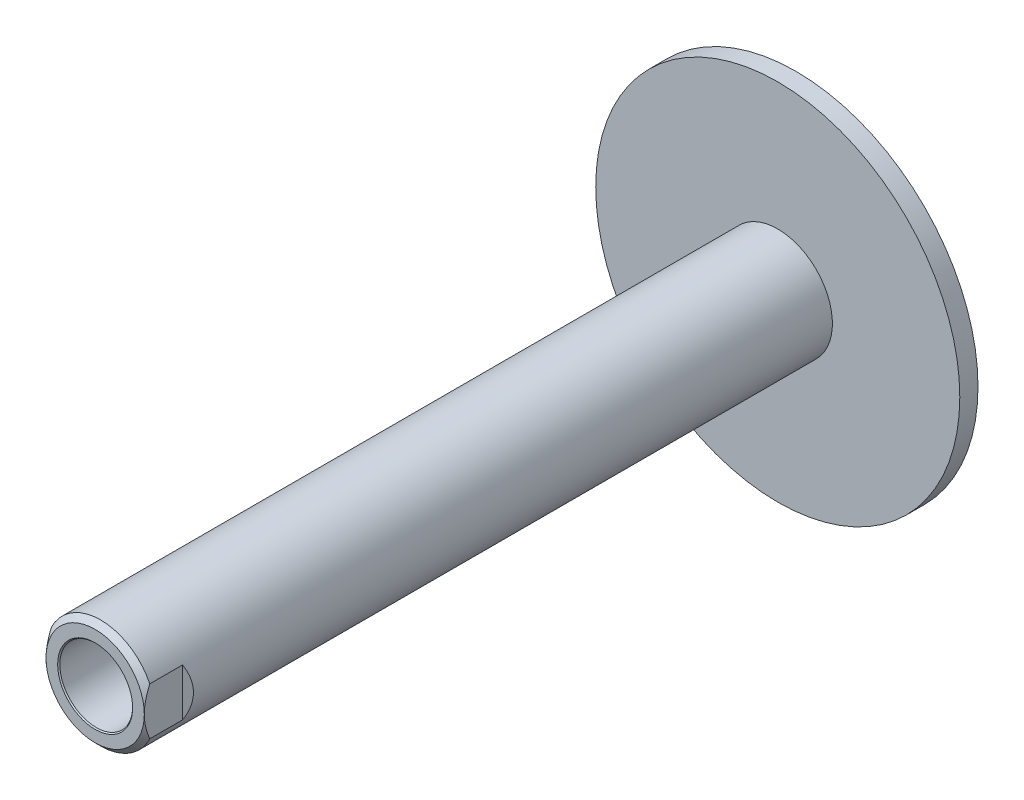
ISO-10303-21;
HEADER;
FILE_DESCRIPTION(('STEP AP214'),'2;1');
FILE_NAME('part.step','',(''),(''),'','','');
FILE_SCHEMA(('AUTOMOTIVE_DESIGN { 1 0 10303 214 1 1 1 1 }'));
ENDSEC;
DATA;
#1=APPLICATION_CONTEXT('core data for automotive mechanical design processes');
#2=APPLICATION_PROTOCOL_DEFINITION('international standard','automotive_design',2000,#1);
#3=PRODUCT_CONTEXT('',#1,'mechanical');
#4=PRODUCT('Part','Part','',(#3));
#5=PRODUCT_RELATED_PRODUCT_CATEGORY('part','',(#4));
#6=PRODUCT_DEFINITION_FORMATION('','',#4);
#7=PRODUCT_DEFINITION_CONTEXT('part definition',#1,'design');
#8=PRODUCT_DEFINITION('design','',#6,#7);
#9=PRODUCT_DEFINITION_SHAPE('','',#8);
#10=(LENGTH_UNIT() NAMED_UNIT(*) SI_UNIT(.MILLI.,.METRE.));
#11=(NAMED_UNIT(*) PLANE_ANGLE_UNIT() SI_UNIT($,.RADIAN.));
#12=(NAMED_UNIT(*) SI_UNIT($,.STERADIAN.) SOLID_ANGLE_UNIT());
#13=UNCERTAINTY_MEASURE_WITH_UNIT(LENGTH_MEASURE(1.E-05),#10,'distance_accuracy_value','');
#14=(GEOMETRIC_REPRESENTATION_CONTEXT(3) GLOBAL_UNCERTAINTY_ASSIGNED_CONTEXT((#13)) GLOBAL_UNIT_ASSIGNED_CONTEXT((#10,
#11,#12)) REPRESENTATION_CONTEXT('',''));
#15=CARTESIAN_POINT('',(0.,0.,0.));
#16=DIRECTION('',(0.,0.,1.));
#17=DIRECTION('',(1.,0.,0.));
#18=AXIS2_PLACEMENT_3D('',#15,#16,#17);
#19=CARTESIAN_POINT('',(0.,0.,5.));
#20=DIRECTION('',(0.,0.,-1.));
#21=DIRECTION('',(-1.,0.,0.));
#22=AXIS2_PLACEMENT_3D('',#19,#20,#21);
#23=CYLINDRICAL_SURFACE('',#22,15.);
#24=CARTESIAN_POINT('',(0.,0.,191.));
#25=DIRECTION('',(0.,0.,-1.));
#26=DIRECTION('',(-1.,0.,0.));
#27=AXIS2_PLACEMENT_3D('',#24,#25,#26);
#28=CIRCLE('',#27,15.);
#29=CARTESIAN_POINT('',(13.5,-6.538348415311,191.));
#30=VERTEX_POINT('',#29);
#31=CARTESIAN_POINT('',(-13.5,-6.538348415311,191.));
#32=VERTEX_POINT('',#31);
#33=EDGE_CURVE('E103',#30,#32,#28,.T.);
#34=ORIENTED_EDGE('',*,*,#33,.T.);
#35=DIRECTION('',(0.,0.,1.));
#36=VECTOR('',#35,1.);
#37=CARTESIAN_POINT('',(-13.5,-6.538348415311,180.5));
#38=LINE('',#37,#36);
#39=CARTESIAN_POINT('',(-13.5,-6.538348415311,182.));
#40=VERTEX_POINT('',#39);
#41=EDGE_CURVE('E85',#40,#32,#38,.T.);
#42=ORIENTED_EDGE('',*,*,#41,.F.);
#43=CARTESIAN_POINT('',(0.,0.,195.5));
#44=DIRECTION('',(0.707106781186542,0.,-0.707106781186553));
#45=DIRECTION('',(-0.707106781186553,0.,-0.707106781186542));
#46=AXIS2_PLACEMENT_3D('',#43,#44,#45);
#47=ELLIPSE('',#46,21.2132034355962,15.);
#48=CARTESIAN_POINT('',(-15.,0.,180.5));
#49=VERTEX_POINT('',#48);
#50=EDGE_CURVE('E56',#40,#49,#47,.T.);
#51=ORIENTED_EDGE('',*,*,#50,.T.);
#52=CARTESIAN_POINT('',(0.,0.,195.5));
#53=DIRECTION('',(0.707106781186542,0.,-0.707106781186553));
#54=DIRECTION('',(-0.707106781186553,0.,-0.707106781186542));
#55=AXIS2_PLACEMENT_3D('',#52,#53,#54);
#56=ELLIPSE('',#55,21.2132034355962,15.);
#57=CARTESIAN_POINT('',(-13.5,6.538348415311,182.));
#58=VERTEX_POINT('',#57);
#59=EDGE_CURVE('E199',#49,#58,#56,.T.);
#60=ORIENTED_EDGE('',*,*,#59,.T.);
#61=DIRECTION('',(0.,0.,1.));
#62=VECTOR('',#61,1.);
#63=CARTESIAN_POINT('',(-13.5,6.538348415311,180.5));
#64=LINE('',#63,#62);
#65=CARTESIAN_POINT('',(-13.5,6.538348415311,191.));
#66=VERTEX_POINT('',#65);
#67=EDGE_CURVE('E95',#58,#66,#64,.T.);
#68=ORIENTED_EDGE('',*,*,#67,.T.);
#69=CARTESIAN_POINT('',(13.5,6.538348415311,191.));
#70=VERTEX_POINT('',#69);
#71=EDGE_CURVE('E112',#66,#70,#28,.T.);
#72=ORIENTED_EDGE('',*,*,#71,.T.);
#73=DIRECTION('',(0.,0.,1.));
#74=VECTOR('',#73,1.);
#75=CARTESIAN_POINT('',(13.5,6.538348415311,180.5));
#76=LINE('',#75,#74);
#77=CARTESIAN_POINT('',(13.5,6.538348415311,182.));
#78=VERTEX_POINT('',#77);
#79=EDGE_CURVE('E118',#78,#70,#76,.T.);
#80=ORIENTED_EDGE('',*,*,#79,.F.);
#81=CARTESIAN_POINT('',(0.,0.,195.5));
#82=DIRECTION('',(-0.707106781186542,0.,-0.707106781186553));
#83=DIRECTION('',(0.707106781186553,0.,-0.707106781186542));
#84=AXIS2_PLACEMENT_3D('',#81,#82,#83);
#85=ELLIPSE('',#84,21.2132034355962,15.);
#86=CARTESIAN_POINT('',(15.,0.,180.5));
#87=VERTEX_POINT('',#86);
#88=EDGE_CURVE('E49',#78,#87,#85,.T.);
#89=ORIENTED_EDGE('',*,*,#88,.T.);
#90=CARTESIAN_POINT('',(0.,0.,195.5));
#91=DIRECTION('',(-0.707106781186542,0.,-0.707106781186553));
#92=DIRECTION('',(0.707106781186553,0.,-0.707106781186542));
#93=AXIS2_PLACEMENT_3D('',#90,#91,#92);
#94=ELLIPSE('',#93,21.2132034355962,15.);
#95=CARTESIAN_POINT('',(13.5,-6.538348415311,182.));
#96=VERTEX_POINT('',#95);
#97=EDGE_CURVE('E204',#87,#96,#94,.T.);
#98=ORIENTED_EDGE('',*,*,#97,.T.);
#99=DIRECTION('',(0.,0.,1.));
#100=VECTOR('',#99,1.);
#101=CARTESIAN_POINT('',(13.5,-6.538348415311,180.5));
#102=LINE('',#101,#100);
#103=EDGE_CURVE('E110',#96,#30,#102,.T.);
#104=ORIENTED_EDGE('',*,*,#103,.T.);
#105=EDGE_LOOP('',(#34,#42,#51,#60,#68,#72,#80,#89,#98,#104));
#106=FACE_BOUND('',#105,.T.);
#107=CARTESIAN_POINT('',(0.,0.,5.));
#108=DIRECTION('',(0.,0.,-1.));
#109=DIRECTION('',(-1.,0.,0.));
#110=AXIS2_PLACEMENT_3D('',#107,#108,#109);
#111=CIRCLE('',#110,15.);
#112=CARTESIAN_POINT('',(-15.,0.,5.));
#113=VERTEX_POINT('',#112);
#114=EDGE_CURVE('E11',#113,#113,#111,.T.);
#115=ORIENTED_EDGE('',*,*,#114,.F.);
#116=EDGE_LOOP('',(#115));
#117=FACE_BOUND('',#116,.T.);
#118=ADVANCED_FACE('F34',(#106,#117),#23,.T.);
#119=CARTESIAN_POINT('',(0.,0.,191.));
#120=DIRECTION('',(0.,0.,-1.));
#121=DIRECTION('',(-1.,0.,0.));
#122=AXIS2_PLACEMENT_3D('',#119,#120,#121);
#123=CONICAL_SURFACE('',#122,15.,0.785398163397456);
#124=CARTESIAN_POINT('',(-13.5,-14.1093196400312,186.472509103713));
#125=CARTESIAN_POINT('',(-13.5,-13.7600597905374,186.724804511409));
#126=CARTESIAN_POINT('',(-13.5,-13.4087034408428,186.974247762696));
#127=CARTESIAN_POINT('',(-13.5,-12.7010407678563,187.466216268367));
#128=CARTESIAN_POINT('',(-13.5,-12.3447330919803,187.70873957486));
#129=CARTESIAN_POINT('',(-13.5,-11.6238899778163,188.187314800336));
#130=CARTESIAN_POINT('',(-13.5,-11.2593126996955,188.423303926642));
#131=CARTESIAN_POINT('',(-13.5,-10.5238062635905,188.885136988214));
#132=CARTESIAN_POINT('',(-13.5,-10.1528775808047,189.110981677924));
#133=CARTESIAN_POINT('',(-13.5,-9.38688961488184,189.560317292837));
#134=CARTESIAN_POINT('',(-13.5,-8.99149666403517,189.783242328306));
#135=CARTESIAN_POINT('',(-13.5,-8.1917499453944,190.21263349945));
#136=CARTESIAN_POINT('',(-13.5,-7.7873949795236,190.419097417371));
#137=CARTESIAN_POINT('',(-13.5,-6.97004306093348,190.811080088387));
#138=CARTESIAN_POINT('',(-13.5,-6.5570749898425,190.996658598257));
#139=CARTESIAN_POINT('',(-13.5,-5.72086976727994,191.342796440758));
#140=CARTESIAN_POINT('',(-13.5,-5.29763679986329,191.503365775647));
#141=CARTESIAN_POINT('',(-13.5,-4.45321540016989,191.789858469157));
#142=CARTESIAN_POINT('',(-13.5,-4.03232652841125,191.91665479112));
#143=CARTESIAN_POINT('',(-13.5,-3.18160115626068,192.13623887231));
#144=CARTESIAN_POINT('',(-13.5,-2.75176397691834,192.229024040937));
#145=CARTESIAN_POINT('',(-13.5,-1.89221463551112,192.374507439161));
#146=CARTESIAN_POINT('',(-13.5,-1.46260700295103,192.427813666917));
#147=CARTESIAN_POINT('',(-13.5,-0.600261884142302,192.493496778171));
#148=CARTESIAN_POINT('',(-13.5,-0.167524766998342,192.505878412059));
#149=CARTESIAN_POINT('',(-13.5,0.686470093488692,192.489136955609));
#150=CARTESIAN_POINT('',(-13.5,1.10774839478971,192.461027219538));
#151=CARTESIAN_POINT('',(-13.5,1.94601035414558,192.366828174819));
#152=CARTESIAN_POINT('',(-13.5,2.36299355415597,192.300734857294));
#153=CARTESIAN_POINT('',(-13.5,3.19667688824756,192.132802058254));
#154=CARTESIAN_POINT('',(-13.5,3.61326149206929,192.030397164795));
#155=CARTESIAN_POINT('',(-13.5,4.43747560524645,191.794891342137));
#156=CARTESIAN_POINT('',(-13.5,4.84510627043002,191.66179440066));
#157=CARTESIAN_POINT('',(-13.5,5.72286800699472,191.343765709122));
#158=CARTESIAN_POINT('',(-13.5,6.19116936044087,191.153822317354));
#159=CARTESIAN_POINT('',(-13.5,7.11523971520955,190.745338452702));
#160=CARTESIAN_POINT('',(-13.5,7.57100225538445,190.526783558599));
#161=CARTESIAN_POINT('',(-13.5,8.47243764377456,190.066338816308));
#162=CARTESIAN_POINT('',(-13.5,8.91807108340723,189.824372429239));
#163=CARTESIAN_POINT('',(-13.5,9.79895577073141,189.322513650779));
#164=CARTESIAN_POINT('',(-13.5,10.2342087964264,189.062624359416));
#165=CARTESIAN_POINT('',(-13.5,11.0737308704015,188.542201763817));
#166=CARTESIAN_POINT('',(-13.5,11.4784451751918,188.282382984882));
#167=CARTESIAN_POINT('',(-13.5,12.2809503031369,187.752232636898));
#168=CARTESIAN_POINT('',(-13.5,12.6787405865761,187.481900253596));
#169=CARTESIAN_POINT('',(-13.5,13.4650094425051,186.93491654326));
#170=CARTESIAN_POINT('',(-13.5,13.8535380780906,186.658337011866));
#171=CARTESIAN_POINT('',(-13.5,14.4324369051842,186.238227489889));
#172=CARTESIAN_POINT('',(-13.5,14.6247300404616,186.097335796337));
#173=CARTESIAN_POINT('',(-13.5,15.0081193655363,185.813940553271));
#174=CARTESIAN_POINT('',(-13.5,15.1992155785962,185.671437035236));
#175=CARTESIAN_POINT('',(-13.5,15.3897591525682,185.528197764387));
#176=B_SPLINE_CURVE_WITH_KNOTS('',3,(#124,#125,#126,#127,#128,#129,#130,#131,#132,#133,#134,
#135,#136,#137,#138,#139,#140,#141,#142,#143,#144,#145,#146,#147,#148,#149,#150,#151,#152,#153,
#154,#155,#156,#157,#158,#159,#160,#161,#162,#163,#164,#165,#166,#167,#168,#169,#170,#171,#172,
#173,#174,#175),.UNSPECIFIED.,.F.,.F.,(4,2,2,2,2,2,2,2,2,2,2,2,2,2,2,2,2,2,2,2,2,2,2,2,2,4),(0.,
1.29259193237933,2.58554419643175,3.88827218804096,5.19090313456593,6.5523036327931,
7.91388723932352,9.27147037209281,10.6285091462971,11.9460185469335,13.2636282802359,
14.5604982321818,15.8572176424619,17.1220431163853,18.3870021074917,19.6725915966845,
20.958014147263,22.4728538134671,23.9884599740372,25.5092002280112,27.0296781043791,
28.4722925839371,29.9150190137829,31.3456741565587,32.0608205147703,32.7759529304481),.UNSPECIFIED.);
#177=CARTESIAN_POINT('',(-13.5,0.,192.5));
#178=VERTEX_POINT('',#177);
#179=EDGE_CURVE('E90',#32,#178,#176,.T.);
#180=ORIENTED_EDGE('',*,*,#179,.F.);
#181=ORIENTED_EDGE('',*,*,#33,.F.);
#182=CARTESIAN_POINT('',(13.5,-14.1093196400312,186.472509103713));
#183=CARTESIAN_POINT('',(13.5,-13.7600597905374,186.724804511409));
#184=CARTESIAN_POINT('',(13.5,-13.4087034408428,186.974247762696));
#185=CARTESIAN_POINT('',(13.5,-12.7010407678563,187.466216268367));
#186=CARTESIAN_POINT('',(13.5,-12.3447330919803,187.70873957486));
#187=CARTESIAN_POINT('',(13.5,-11.6238899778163,188.187314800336));
#188=CARTESIAN_POINT('',(13.5,-11.2593126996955,188.423303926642));
#189=CARTESIAN_POINT('',(13.5,-10.5238062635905,188.885136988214));
#190=CARTESIAN_POINT('',(13.5,-10.1528775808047,189.110981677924));
#191=CARTESIAN_POINT('',(13.5,-9.38688961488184,189.560317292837));
#192=CARTESIAN_POINT('',(13.5,-8.99149666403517,189.783242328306));
#193=CARTESIAN_POINT('',(13.5,-8.1917499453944,190.21263349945));
#194=CARTESIAN_POINT('',(13.5,-7.7873949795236,190.419097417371));
#195=CARTESIAN_POINT('',(13.5,-6.97004306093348,190.811080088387));
#196=CARTESIAN_POINT('',(13.5,-6.5570749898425,190.996658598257));
#197=CARTESIAN_POINT('',(13.5,-5.72086976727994,191.342796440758));
#198=CARTESIAN_POINT('',(13.5,-5.29763679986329,191.503365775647));
#199=CARTESIAN_POINT('',(13.5,-4.45321540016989,191.789858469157));
#200=CARTESIAN_POINT('',(13.5,-4.03232652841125,191.91665479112));
#201=CARTESIAN_POINT('',(13.5,-3.18160115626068,192.13623887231));
#202=CARTESIAN_POINT('',(13.5,-2.75176397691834,192.229024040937));
#203=CARTESIAN_POINT('',(13.5,-1.89221463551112,192.374507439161));
#204=CARTESIAN_POINT('',(13.5,-1.46260700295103,192.427813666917));
#205=CARTESIAN_POINT('',(13.5,-0.600261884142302,192.493496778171));
#206=CARTESIAN_POINT('',(13.5,-0.167524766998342,192.505878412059));
#207=CARTESIAN_POINT('',(13.5,0.686470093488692,192.489136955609));
#208=CARTESIAN_POINT('',(13.5,1.10774839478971,192.461027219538));
#209=CARTESIAN_POINT('',(13.5,1.94601035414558,192.366828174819));
#210=CARTESIAN_POINT('',(13.5,2.36299355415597,192.300734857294));
#211=CARTESIAN_POINT('',(13.5,3.19667688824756,192.132802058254));
#212=CARTESIAN_POINT('',(13.5,3.61326149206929,192.030397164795));
#213=CARTESIAN_POINT('',(13.5,4.43747560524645,191.794891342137));
#214=CARTESIAN_POINT('',(13.5,4.84510627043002,191.66179440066));
#215=CARTESIAN_POINT('',(13.5,5.72286800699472,191.343765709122));
#216=CARTESIAN_POINT('',(13.5,6.19116936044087,191.153822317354));
#217=CARTESIAN_POINT('',(13.5,7.11523971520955,190.745338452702));
#218=CARTESIAN_POINT('',(13.5,7.57100225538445,190.526783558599));
#219=CARTESIAN_POINT('',(13.5,8.47243764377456,190.066338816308));
#220=CARTESIAN_POINT('',(13.5,8.91807108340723,189.824372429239));
#221=CARTESIAN_POINT('',(13.5,9.79895577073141,189.322513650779));
#222=CARTESIAN_POINT('',(13.5,10.2342087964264,189.062624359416));
#223=CARTESIAN_POINT('',(13.5,11.0737308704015,188.542201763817));
#224=CARTESIAN_POINT('',(13.5,11.4784451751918,188.282382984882));
#225=CARTESIAN_POINT('',(13.5,12.2809503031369,187.752232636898));
#226=CARTESIAN_POINT('',(13.5,12.6787405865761,187.481900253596));
#227=CARTESIAN_POINT('',(13.5,13.4650094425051,186.93491654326));
#228=CARTESIAN_POINT('',(13.5,13.8535380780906,186.658337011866));
#229=CARTESIAN_POINT('',(13.5,14.4324369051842,186.238227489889));
#230=CARTESIAN_POINT('',(13.5,14.6247300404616,186.097335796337));
#231=CARTESIAN_POINT('',(13.5,15.0081193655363,185.813940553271));
#232=CARTESIAN_POINT('',(13.5,15.1992155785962,185.671437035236));
#233=CARTESIAN_POINT('',(13.5,15.3897591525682,185.528197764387));
#234=B_SPLINE_CURVE_WITH_KNOTS('',3,(#182,#183,#184,#185,#186,#187,#188,#189,#190,#191,#192,
#193,#194,#195,#196,#197,#198,#199,#200,#201,#202,#203,#204,#205,#206,#207,#208,#209,#210,#211,
#212,#213,#214,#215,#216,#217,#218,#219,#220,#221,#222,#223,#224,#225,#226,#227,#228,#229,#230,
#231,#232,#233),.UNSPECIFIED.,.F.,.F.,(4,2,2,2,2,2,2,2,2,2,2,2,2,2,2,2,2,2,2,2,2,2,2,2,2,4),(0.,
1.29259193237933,2.58554419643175,3.88827218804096,5.19090313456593,6.5523036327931,
7.91388723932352,9.27147037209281,10.6285091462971,11.9460185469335,13.2636282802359,
14.5604982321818,15.8572176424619,17.1220431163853,18.3870021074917,19.6725915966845,
20.958014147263,22.4728538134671,23.9884599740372,25.5092002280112,27.0296781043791,
28.4722925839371,29.9150190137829,31.3456741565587,32.0608205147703,32.7759529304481),.UNSPECIFIED.);
#235=CARTESIAN_POINT('',(13.5,0.,192.5));
#236=VERTEX_POINT('',#235);
#237=EDGE_CURVE('E121',#236,#30,#234,.F.);
#238=ORIENTED_EDGE('',*,*,#237,.F.);
#239=CARTESIAN_POINT('',(0.,0.,192.5));
#240=DIRECTION('',(0.,0.,-1.));
#241=DIRECTION('',(-1.,0.,0.));
#242=AXIS2_PLACEMENT_3D('',#239,#240,#241);
#243=CIRCLE('',#242,13.5);
#244=EDGE_CURVE('E104',#178,#236,#243,.F.);
#245=ORIENTED_EDGE('',*,*,#244,.F.);
#246=EDGE_LOOP('',(#180,#181,#238,#245));
#247=FACE_BOUND('',#246,.T.);
#248=ADVANCED_FACE('F101',(#247),#123,.T.);
#249=CARTESIAN_POINT('',(0.,0.,192.5));
#250=DIRECTION('',(0.,0.,-1.));
#251=DIRECTION('',(-1.,0.,0.));
#252=AXIS2_PLACEMENT_3D('',#249,#250,#251);
#253=PLANE('',#252);
#254=CARTESIAN_POINT('',(0.,0.,192.5));
#255=DIRECTION('',(0.,0.,-1.));
#256=DIRECTION('',(-1.,0.,0.));
#257=AXIS2_PLACEMENT_3D('',#254,#255,#256);
#258=CIRCLE('',#257,10.3);
#259=CARTESIAN_POINT('',(-10.3,0.,192.5));
#260=VERTEX_POINT('',#259);
#261=EDGE_CURVE('E42',#260,#260,#258,.T.);
#262=ORIENTED_EDGE('',*,*,#261,.T.);
#263=EDGE_LOOP('',(#262));
#264=FACE_BOUND('',#263,.T.);
#265=EDGE_CURVE('E114',#236,#178,#243,.F.);
#266=ORIENTED_EDGE('',*,*,#265,.T.);
#267=ORIENTED_EDGE('',*,*,#244,.T.);
#268=EDGE_LOOP('',(#266,#267));
#269=FACE_BOUND('',#268,.T.);
#270=ADVANCED_FACE('F141',(#264,#269),#253,.F.);
#271=EDGE_CURVE('E106',#178,#66,#176,.T.);
#272=ORIENTED_EDGE('',*,*,#271,.F.);
#273=ORIENTED_EDGE('',*,*,#265,.F.);
#274=EDGE_CURVE('E127',#70,#236,#234,.F.);
#275=ORIENTED_EDGE('',*,*,#274,.F.);
#276=ORIENTED_EDGE('',*,*,#71,.F.);
#277=EDGE_LOOP('',(#272,#273,#275,#276));
#278=FACE_BOUND('',#277,.T.);
#279=ADVANCED_FACE('F136',(#278),#123,.T.);
#280=CARTESIAN_POINT('',(13.5,6.538348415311,180.5));
#281=DIRECTION('',(-1.,0.,0.));
#282=DIRECTION('',(0.,0.,1.));
#283=AXIS2_PLACEMENT_3D('',#280,#281,#282);
#284=PLANE('',#283);
#285=ORIENTED_EDGE('',*,*,#103,.F.);
#286=DIRECTION('',(0.,1.,0.));
#287=VECTOR('',#286,1.);
#288=CARTESIAN_POINT('',(13.5,6.538348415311,182.));
#289=LINE('',#288,#287);
#290=EDGE_CURVE('E196',#96,#78,#289,.T.);
#291=ORIENTED_EDGE('',*,*,#290,.T.);
#292=ORIENTED_EDGE('',*,*,#79,.T.);
#293=ORIENTED_EDGE('',*,*,#274,.T.);
#294=ORIENTED_EDGE('',*,*,#237,.T.);
#295=EDGE_LOOP('',(#285,#291,#292,#293,#294));
#296=FACE_BOUND('',#295,.T.);
#297=ADVANCED_FACE('F133',(#296),#284,.F.);
#298=CARTESIAN_POINT('',(-13.5,6.538348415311,180.5));
#299=DIRECTION('',(1.,0.,0.));
#300=DIRECTION('',(0.,0.,-1.));
#301=AXIS2_PLACEMENT_3D('',#298,#299,#300);
#302=PLANE('',#301);
#303=ORIENTED_EDGE('',*,*,#67,.F.);
#304=DIRECTION('',(0.,-1.,0.));
#305=VECTOR('',#304,1.);
#306=CARTESIAN_POINT('',(-13.5,6.538348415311,182.));
#307=LINE('',#306,#305);
#308=EDGE_CURVE('E93',#58,#40,#307,.T.);
#309=ORIENTED_EDGE('',*,*,#308,.T.);
#310=ORIENTED_EDGE('',*,*,#41,.T.);
#311=ORIENTED_EDGE('',*,*,#179,.T.);
#312=ORIENTED_EDGE('',*,*,#271,.T.);
#313=EDGE_LOOP('',(#303,#309,#310,#311,#312));
#314=FACE_BOUND('',#313,.T.);
#315=ADVANCED_FACE('F88',(#314),#302,.F.);
#316=CARTESIAN_POINT('',(-15.,0.,180.5));
#317=DIRECTION('',(0.707106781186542,0.,-0.707106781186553));
#318=DIRECTION('',(-0.707106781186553,0.,-0.707106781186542));
#319=AXIS2_PLACEMENT_3D('',#316,#317,#318);
#320=PLANE('',#319);
#321=ORIENTED_EDGE('',*,*,#50,.F.);
#322=ORIENTED_EDGE('',*,*,#308,.F.);
#323=ORIENTED_EDGE('',*,*,#59,.F.);
#324=EDGE_LOOP('',(#321,#322,#323));
#325=FACE_BOUND('',#324,.T.);
#326=ADVANCED_FACE('F144',(#325),#320,.F.);
#327=CARTESIAN_POINT('',(15.,0.,180.5));
#328=DIRECTION('',(-0.707106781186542,0.,-0.707106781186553));
#329=DIRECTION('',(-0.707106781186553,0.,0.707106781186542));
#330=AXIS2_PLACEMENT_3D('',#327,#328,#329);
#331=PLANE('',#330);
#332=ORIENTED_EDGE('',*,*,#88,.F.);
#333=ORIENTED_EDGE('',*,*,#290,.F.);
#334=ORIENTED_EDGE('',*,*,#97,.F.);
#335=EDGE_LOOP('',(#332,#333,#334));
#336=FACE_BOUND('',#335,.T.);
#337=ADVANCED_FACE('F147',(#336),#331,.F.);
#338=CARTESIAN_POINT('',(0.,0.,165.5));
#339=DIRECTION('',(0.,0.,1.));
#340=DIRECTION('',(1.,0.,0.));
#341=AXIS2_PLACEMENT_3D('',#338,#339,#340);
#342=CYLINDRICAL_SURFACE('',#341,10.);
#343=CARTESIAN_POINT('',(0.,0.,192.2));
#344=DIRECTION('',(0.,0.,-1.));
#345=DIRECTION('',(-1.,0.,0.));
#346=AXIS2_PLACEMENT_3D('',#343,#344,#345);
#347=CIRCLE('',#346,10.);
#348=CARTESIAN_POINT('',(-10.,0.,192.2));
#349=VERTEX_POINT('',#348);
#350=EDGE_CURVE('E207',#349,#349,#347,.F.);
#351=ORIENTED_EDGE('',*,*,#350,.T.);
#352=EDGE_LOOP('',(#351));
#353=FACE_BOUND('',#352,.T.);
#354=CARTESIAN_POINT('',(0.,0.,165.5));
#355=DIRECTION('',(0.,0.,1.));
#356=DIRECTION('',(1.,0.,0.));
#357=AXIS2_PLACEMENT_3D('',#354,#355,#356);
#358=CIRCLE('',#357,10.);
#359=CARTESIAN_POINT('',(10.,0.,165.5));
#360=VERTEX_POINT('',#359);
#361=EDGE_CURVE('E96',#360,#360,#358,.T.);
#362=ORIENTED_EDGE('',*,*,#361,.F.);
#363=EDGE_LOOP('',(#362));
#364=FACE_BOUND('',#363,.T.);
#365=ADVANCED_FACE('F150',(#353,#364),#342,.F.);
#366=CARTESIAN_POINT('',(0.,0.,165.5));
#367=DIRECTION('',(0.,0.,1.));
#368=DIRECTION('',(1.,0.,0.));
#369=AXIS2_PLACEMENT_3D('',#366,#367,#368);
#370=PLANE('',#369);
#371=ORIENTED_EDGE('',*,*,#361,.T.);
#372=EDGE_LOOP('',(#371));
#373=FACE_BOUND('',#372,.T.);
#374=ADVANCED_FACE('F155',(#373),#370,.T.);
#375=CARTESIAN_POINT('',(0.,0.,192.2));
#376=DIRECTION('',(0.,0.,1.));
#377=DIRECTION('',(1.,0.,0.));
#378=AXIS2_PLACEMENT_3D('',#375,#376,#377);
#379=CONICAL_SURFACE('',#378,10.,0.78539816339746);
#380=ORIENTED_EDGE('',*,*,#261,.F.);
#381=EDGE_LOOP('',(#380));
#382=FACE_BOUND('',#381,.T.);
#383=ORIENTED_EDGE('',*,*,#350,.F.);
#384=EDGE_LOOP('',(#383));
#385=FACE_BOUND('',#384,.T.);
#386=ADVANCED_FACE('F36',(#382,#385),#379,.F.);
#387=CARTESIAN_POINT('',(0.,0.,5.));
#388=DIRECTION('',(0.,0.,-1.));
#389=DIRECTION('',(-1.,0.,0.));
#390=AXIS2_PLACEMENT_3D('',#387,#388,#389);
#391=PLANE('',#390);
#392=CARTESIAN_POINT('',(0.,0.,5.));
#393=DIRECTION('',(0.,0.,-1.));
#394=DIRECTION('',(-1.,0.,0.));
#395=AXIS2_PLACEMENT_3D('',#392,#393,#394);
#396=CIRCLE('',#395,50.);
#397=CARTESIAN_POINT('',(-50.,0.,5.));
#398=VERTEX_POINT('',#397);
#399=EDGE_CURVE('E184',#398,#398,#396,.T.);
#400=ORIENTED_EDGE('',*,*,#399,.F.);
#401=EDGE_LOOP('',(#400));
#402=FACE_BOUND('',#401,.T.);
#403=ORIENTED_EDGE('',*,*,#114,.T.);
#404=EDGE_LOOP('',(#403));
#405=FACE_BOUND('',#404,.T.);
#406=ADVANCED_FACE('F177',(#402,#405),#391,.F.);
#407=CARTESIAN_POINT('',(0.,0.,5.));
#408=DIRECTION('',(0.,0.,-1.));
#409=DIRECTION('',(-1.,0.,0.));
#410=AXIS2_PLACEMENT_3D('',#407,#408,#409);
#411=CYLINDRICAL_SURFACE('',#410,50.);
#412=ORIENTED_EDGE('',*,*,#399,.T.);
#413=EDGE_LOOP('',(#412));
#414=FACE_BOUND('',#413,.T.);
#415=CARTESIAN_POINT('',(0.,0.,0.));
#416=DIRECTION('',(0.,0.,-1.));
#417=DIRECTION('',(-1.,0.,0.));
#418=AXIS2_PLACEMENT_3D('',#415,#416,#417);
#419=CIRCLE('',#418,50.);
#420=CARTESIAN_POINT('',(-50.,0.,0.));
#421=VERTEX_POINT('',#420);
#422=EDGE_CURVE('E182',#421,#421,#419,.T.);
#423=ORIENTED_EDGE('',*,*,#422,.F.);
#424=EDGE_LOOP('',(#423));
#425=FACE_BOUND('',#424,.T.);
#426=ADVANCED_FACE('F172',(#414,#425),#411,.T.);
#427=CARTESIAN_POINT('',(0.,0.,0.));
#428=DIRECTION('',(0.,0.,1.));
#429=DIRECTION('',(1.,0.,0.));
#430=AXIS2_PLACEMENT_3D('',#427,#428,#429);
#431=PLANE('',#430);
#432=ORIENTED_EDGE('',*,*,#422,.T.);
#433=EDGE_LOOP('',(#432));
#434=FACE_BOUND('',#433,.T.);
#435=ADVANCED_FACE('F170',(#434),#431,.F.);
#436=CLOSED_SHELL('',(#118,#248,#270,#279,#297,#315,#326,#337,#365,#374,#386,#406,#426,#435));
#437=MANIFOLD_SOLID_BREP('B2',#436);
#438=ADVANCED_BREP_SHAPE_REPRESENTATION('',(#18,#437),#14);
#439=SHAPE_DEFINITION_REPRESENTATION(#9,#438);
ENDSEC;
END-ISO-10303-21;
